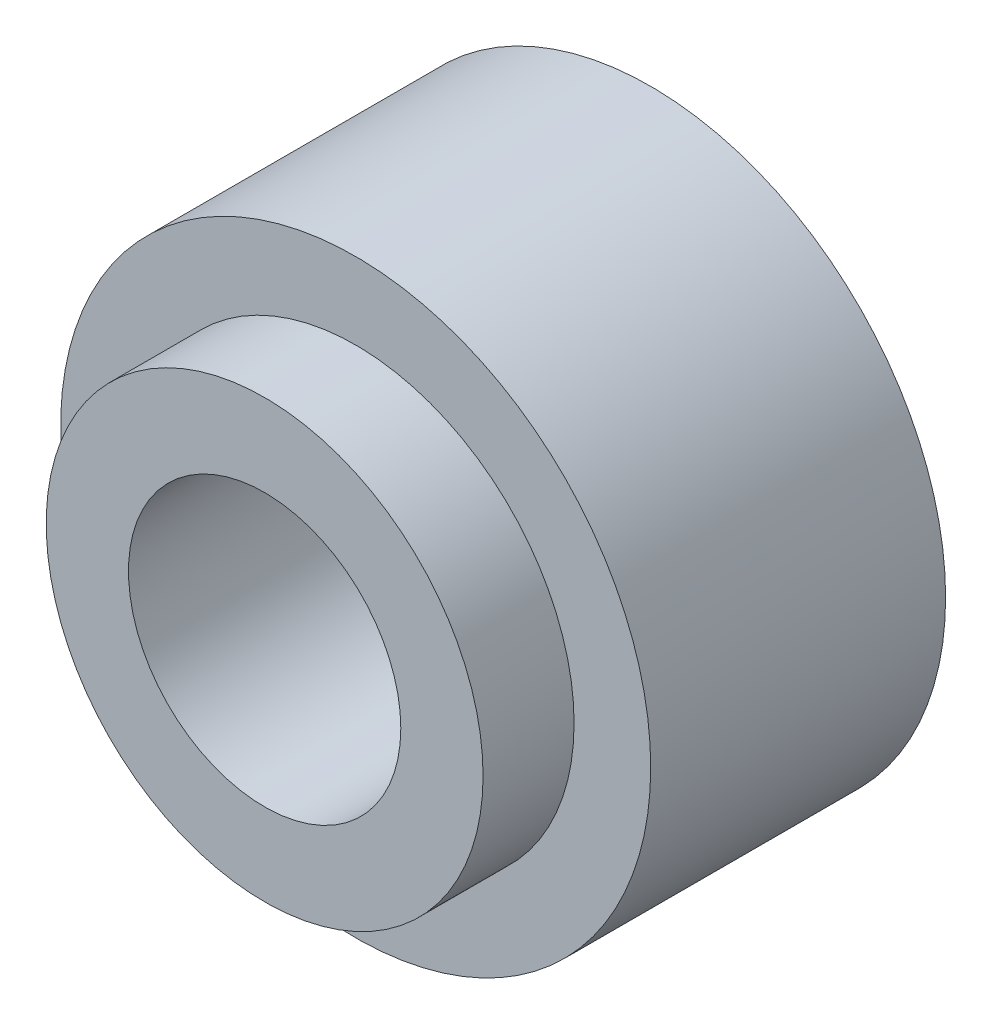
ISO-10303-21;
HEADER;
FILE_DESCRIPTION(('STEP AP214'),'2;1');
FILE_NAME('part.step','',(''),(''),'','','');
FILE_SCHEMA(('AUTOMOTIVE_DESIGN { 1 0 10303 214 1 1 1 1 }'));
ENDSEC;
DATA;
#1=APPLICATION_CONTEXT('core data for automotive mechanical design processes');
#2=APPLICATION_PROTOCOL_DEFINITION('international standard','automotive_design',2000,#1);
#3=PRODUCT_CONTEXT('',#1,'mechanical');
#4=PRODUCT('Part','Part','',(#3));
#5=PRODUCT_RELATED_PRODUCT_CATEGORY('part','',(#4));
#6=PRODUCT_DEFINITION_FORMATION('','',#4);
#7=PRODUCT_DEFINITION_CONTEXT('part definition',#1,'design');
#8=PRODUCT_DEFINITION('design','',#6,#7);
#9=PRODUCT_DEFINITION_SHAPE('','',#8);
#10=(LENGTH_UNIT() NAMED_UNIT(*) SI_UNIT(.MILLI.,.METRE.));
#11=(NAMED_UNIT(*) PLANE_ANGLE_UNIT() SI_UNIT($,.RADIAN.));
#12=(NAMED_UNIT(*) SI_UNIT($,.STERADIAN.) SOLID_ANGLE_UNIT());
#13=UNCERTAINTY_MEASURE_WITH_UNIT(LENGTH_MEASURE(1.E-05),#10,'distance_accuracy_value','');
#14=(GEOMETRIC_REPRESENTATION_CONTEXT(3) GLOBAL_UNCERTAINTY_ASSIGNED_CONTEXT((#13)) GLOBAL_UNIT_ASSIGNED_CONTEXT((#10,
#11,#12)) REPRESENTATION_CONTEXT('',''));
#15=CARTESIAN_POINT('',(0.,0.,0.));
#16=DIRECTION('',(0.,0.,1.));
#17=DIRECTION('',(1.,0.,0.));
#18=AXIS2_PLACEMENT_3D('',#15,#16,#17);
#19=CARTESIAN_POINT('',(0.,0.,-13.462));
#20=DIRECTION('',(0.,0.,1.));
#21=DIRECTION('',(1.,0.,0.));
#22=AXIS2_PLACEMENT_3D('',#19,#20,#21);
#23=CYLINDRICAL_SURFACE('',#22,10.29335);
#24=CARTESIAN_POINT('',(0.,0.,-13.462));
#25=DIRECTION('',(0.,0.,1.));
#26=DIRECTION('',(1.,0.,0.));
#27=AXIS2_PLACEMENT_3D('',#24,#25,#26);
#28=CIRCLE('',#27,10.29335);
#29=CARTESIAN_POINT('',(10.29335,0.,-13.462));
#30=VERTEX_POINT('',#29);
#31=EDGE_CURVE('E10',#30,#30,#28,.T.);
#32=ORIENTED_EDGE('',*,*,#31,.T.);
#33=EDGE_LOOP('',(#32));
#34=FACE_BOUND('',#33,.T.);
#35=CARTESIAN_POINT('',(0.,0.,-3.175));
#36=DIRECTION('',(0.,0.,1.));
#37=DIRECTION('',(1.,0.,0.));
#38=AXIS2_PLACEMENT_3D('',#35,#36,#37);
#39=CIRCLE('',#38,10.29335);
#40=CARTESIAN_POINT('',(10.29335,0.,-3.175));
#41=VERTEX_POINT('',#40);
#42=EDGE_CURVE('E36',#41,#41,#39,.T.);
#43=ORIENTED_EDGE('',*,*,#42,.F.);
#44=EDGE_LOOP('',(#43));
#45=FACE_BOUND('',#44,.T.);
#46=ADVANCED_FACE('F30',(#34,#45),#23,.T.);
#47=CARTESIAN_POINT('',(0.,0.,-13.462));
#48=DIRECTION('',(0.,0.,1.));
#49=DIRECTION('',(1.,0.,0.));
#50=AXIS2_PLACEMENT_3D('',#47,#48,#49);
#51=PLANE('',#50);
#52=CARTESIAN_POINT('',(0.,0.,-13.462));
#53=DIRECTION('',(0.,0.,1.));
#54=DIRECTION('',(1.,0.,0.));
#55=AXIS2_PLACEMENT_3D('',#52,#53,#54);
#56=CIRCLE('',#55,4.7498);
#57=CARTESIAN_POINT('',(4.7498,0.,-13.462));
#58=VERTEX_POINT('',#57);
#59=EDGE_CURVE('E49',#58,#58,#56,.T.);
#60=ORIENTED_EDGE('',*,*,#59,.T.);
#61=EDGE_LOOP('',(#60));
#62=FACE_BOUND('',#61,.T.);
#63=ORIENTED_EDGE('',*,*,#31,.F.);
#64=EDGE_LOOP('',(#63));
#65=FACE_BOUND('',#64,.T.);
#66=ADVANCED_FACE('F76',(#62,#65),#51,.F.);
#67=CARTESIAN_POINT('',(0.,0.,-3.175));
#68=DIRECTION('',(0.,0.,1.));
#69=DIRECTION('',(1.,0.,0.));
#70=AXIS2_PLACEMENT_3D('',#67,#68,#69);
#71=CYLINDRICAL_SURFACE('',#70,7.62);
#72=CARTESIAN_POINT('',(0.,0.,-3.175));
#73=DIRECTION('',(0.,0.,1.));
#74=DIRECTION('',(1.,0.,0.));
#75=AXIS2_PLACEMENT_3D('',#72,#73,#74);
#76=CIRCLE('',#75,7.62);
#77=CARTESIAN_POINT('',(7.62,0.,-3.175));
#78=VERTEX_POINT('',#77);
#79=EDGE_CURVE('E40',#78,#78,#76,.T.);
#80=ORIENTED_EDGE('',*,*,#79,.T.);
#81=EDGE_LOOP('',(#80));
#82=FACE_BOUND('',#81,.T.);
#83=CARTESIAN_POINT('',(0.,0.,0.));
#84=DIRECTION('',(0.,0.,1.));
#85=DIRECTION('',(1.,0.,0.));
#86=AXIS2_PLACEMENT_3D('',#83,#84,#85);
#87=CIRCLE('',#86,7.62);
#88=CARTESIAN_POINT('',(7.62,0.,0.));
#89=VERTEX_POINT('',#88);
#90=EDGE_CURVE('E45',#89,#89,#87,.T.);
#91=ORIENTED_EDGE('',*,*,#90,.F.);
#92=EDGE_LOOP('',(#91));
#93=FACE_BOUND('',#92,.T.);
#94=ADVANCED_FACE('F71',(#82,#93),#71,.T.);
#95=CARTESIAN_POINT('',(0.,-22.7867913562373,-3.175));
#96=DIRECTION('',(0.,0.,1.));
#97=DIRECTION('',(1.,0.,0.));
#98=AXIS2_PLACEMENT_3D('',#95,#96,#97);
#99=PLANE('',#98);
#100=ORIENTED_EDGE('',*,*,#79,.F.);
#101=EDGE_LOOP('',(#100));
#102=FACE_BOUND('',#101,.T.);
#103=ORIENTED_EDGE('',*,*,#42,.T.);
#104=EDGE_LOOP('',(#103));
#105=FACE_BOUND('',#104,.T.);
#106=ADVANCED_FACE('F64',(#102,#105),#99,.T.);
#107=CARTESIAN_POINT('',(0.,0.,0.));
#108=DIRECTION('',(0.,0.,1.));
#109=DIRECTION('',(1.,0.,0.));
#110=AXIS2_PLACEMENT_3D('',#107,#108,#109);
#111=PLANE('',#110);
#112=CARTESIAN_POINT('',(0.,0.,0.));
#113=DIRECTION('',(0.,0.,1.));
#114=DIRECTION('',(1.,0.,0.));
#115=AXIS2_PLACEMENT_3D('',#112,#113,#114);
#116=CIRCLE('',#115,4.7498);
#117=CARTESIAN_POINT('',(4.7498,0.,0.));
#118=VERTEX_POINT('',#117);
#119=EDGE_CURVE('E53',#118,#118,#116,.T.);
#120=ORIENTED_EDGE('',*,*,#119,.F.);
#121=EDGE_LOOP('',(#120));
#122=FACE_BOUND('',#121,.T.);
#123=ORIENTED_EDGE('',*,*,#90,.T.);
#124=EDGE_LOOP('',(#123));
#125=FACE_BOUND('',#124,.T.);
#126=ADVANCED_FACE('F62',(#122,#125),#111,.T.);
#127=CARTESIAN_POINT('',(0.,0.,-13.462));
#128=DIRECTION('',(0.,0.,1.));
#129=DIRECTION('',(1.,0.,0.));
#130=AXIS2_PLACEMENT_3D('',#127,#128,#129);
#131=CYLINDRICAL_SURFACE('',#130,4.7498);
#132=ORIENTED_EDGE('',*,*,#59,.F.);
#133=EDGE_LOOP('',(#132));
#134=FACE_BOUND('',#133,.T.);
#135=ORIENTED_EDGE('',*,*,#119,.T.);
#136=EDGE_LOOP('',(#135));
#137=FACE_BOUND('',#136,.T.);
#138=ADVANCED_FACE('F60',(#134,#137),#131,.F.);
#139=CLOSED_SHELL('',(#46,#66,#94,#106,#126,#138));
#140=MANIFOLD_SOLID_BREP('B2',#139);
#141=ADVANCED_BREP_SHAPE_REPRESENTATION('',(#18,#140),#14);
#142=SHAPE_DEFINITION_REPRESENTATION(#9,#141);
ENDSEC;
END-ISO-10303-21;
